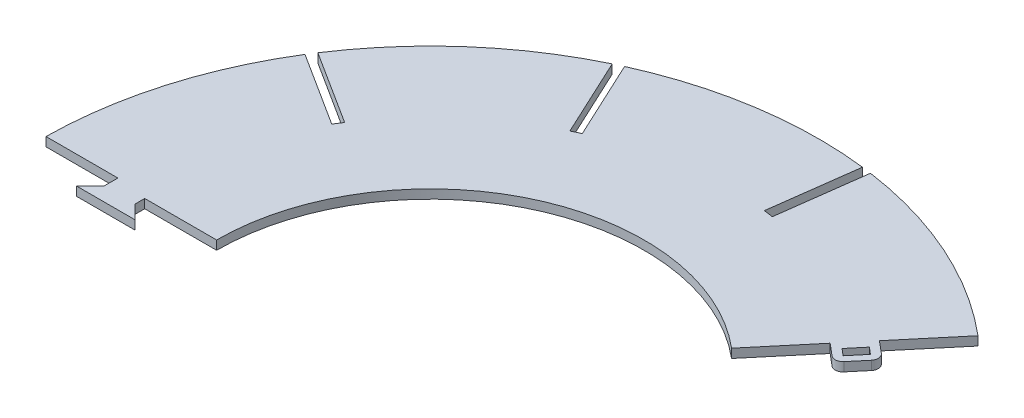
ISO-10303-21;
HEADER;
FILE_DESCRIPTION(('STEP AP214'),'2;1');
FILE_NAME('part.step','',(''),(''),'','','');
FILE_SCHEMA(('AUTOMOTIVE_DESIGN { 1 0 10303 214 1 1 1 1 }'));
ENDSEC;
DATA;
#1=APPLICATION_CONTEXT('core data for automotive mechanical design processes');
#2=APPLICATION_PROTOCOL_DEFINITION('international standard','automotive_design',2000,#1);
#3=PRODUCT_CONTEXT('',#1,'mechanical');
#4=PRODUCT('Part','Part','',(#3));
#5=PRODUCT_RELATED_PRODUCT_CATEGORY('part','',(#4));
#6=PRODUCT_DEFINITION_FORMATION('','',#4);
#7=PRODUCT_DEFINITION_CONTEXT('part definition',#1,'design');
#8=PRODUCT_DEFINITION('design','',#6,#7);
#9=PRODUCT_DEFINITION_SHAPE('','',#8);
#10=(LENGTH_UNIT() NAMED_UNIT(*) SI_UNIT(.MILLI.,.METRE.));
#11=(NAMED_UNIT(*) PLANE_ANGLE_UNIT() SI_UNIT($,.RADIAN.));
#12=(NAMED_UNIT(*) SI_UNIT($,.STERADIAN.) SOLID_ANGLE_UNIT());
#13=UNCERTAINTY_MEASURE_WITH_UNIT(LENGTH_MEASURE(1.E-05),#10,'distance_accuracy_value','');
#14=(GEOMETRIC_REPRESENTATION_CONTEXT(3) GLOBAL_UNCERTAINTY_ASSIGNED_CONTEXT((#13)) GLOBAL_UNIT_ASSIGNED_CONTEXT((#10,
#11,#12)) REPRESENTATION_CONTEXT('',''));
#15=CARTESIAN_POINT('',(0.,0.,0.));
#16=DIRECTION('',(0.,0.,1.));
#17=DIRECTION('',(1.,0.,0.));
#18=AXIS2_PLACEMENT_3D('',#15,#16,#17);
#19=CARTESIAN_POINT('',(263.891483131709,23.,-314.49362307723));
#20=DIRECTION('',(-0.642787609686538,0.,0.766044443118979));
#21=DIRECTION('',(0.766044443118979,0.,0.642787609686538));
#22=AXIS2_PLACEMENT_3D('',#19,#20,#21);
#23=PLANE('',#22);
#24=DIRECTION('',(-0.766044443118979,0.,-0.642787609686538));
#25=VECTOR('',#24,1.);
#26=CARTESIAN_POINT('',(263.891483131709,0.,-314.49362307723));
#27=LINE('',#26,#25);
#28=CARTESIAN_POINT('',(491.131283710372,0.,-123.816790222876));
#29=VERTEX_POINT('',#28);
#30=CARTESIAN_POINT('',(473.512261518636,0.,-138.600905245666));
#31=VERTEX_POINT('',#30);
#32=EDGE_CURVE('E347',#29,#31,#27,.T.);
#33=ORIENTED_EDGE('',*,*,#32,.T.);
#34=DIRECTION('',(0.,-1.,0.));
#35=VECTOR('',#34,1.);
#36=CARTESIAN_POINT('',(473.512261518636,23.,-138.600905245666));
#37=LINE('',#36,#35);
#38=CARTESIAN_POINT('',(473.512261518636,23.,-138.600905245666));
#39=VERTEX_POINT('',#38);
#40=EDGE_CURVE('E11',#39,#31,#37,.T.);
#41=ORIENTED_EDGE('',*,*,#40,.F.);
#42=DIRECTION('',(-0.766044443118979,0.,-0.642787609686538));
#43=VECTOR('',#42,1.);
#44=CARTESIAN_POINT('',(263.891483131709,23.,-314.49362307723));
#45=LINE('',#44,#43);
#46=CARTESIAN_POINT('',(491.131283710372,23.,-123.816790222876));
#47=VERTEX_POINT('',#46);
#48=EDGE_CURVE('E257',#47,#39,#45,.T.);
#49=ORIENTED_EDGE('',*,*,#48,.F.);
#50=DIRECTION('',(0.,-1.,0.));
#51=VECTOR('',#50,1.);
#52=CARTESIAN_POINT('',(491.131283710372,23.,-123.816790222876));
#53=LINE('',#52,#51);
#54=EDGE_CURVE('E53',#47,#29,#53,.T.);
#55=ORIENTED_EDGE('',*,*,#54,.T.);
#56=EDGE_LOOP('',(#33,#41,#49,#55));
#57=FACE_BOUND('',#56,.T.);
#58=ADVANCED_FACE('F34',(#57),#23,.F.);
#59=CARTESIAN_POINT('',(209.620778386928,23.,175.892717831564));
#60=DIRECTION('',(-0.766044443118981,0.,-0.642787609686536));
#61=DIRECTION('',(-0.642787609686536,0.,0.766044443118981));
#62=AXIS2_PLACEMENT_3D('',#59,#60,#61);
#63=PLANE('',#62);
#64=DIRECTION('',(0.642787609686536,0.,-0.766044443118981));
#65=VECTOR('',#64,1.);
#66=CARTESIAN_POINT('',(209.620778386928,0.,175.892717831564));
#67=LINE('',#66,#65);
#68=CARTESIAN_POINT('',(505.651642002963,0.,-176.903127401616));
#69=VERTEX_POINT('',#68);
#70=EDGE_CURVE('E263',#31,#69,#67,.T.);
#71=ORIENTED_EDGE('',*,*,#70,.T.);
#72=DIRECTION('',(0.,-1.,0.));
#73=VECTOR('',#72,1.);
#74=CARTESIAN_POINT('',(505.651642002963,23.,-176.903127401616));
#75=LINE('',#74,#73);
#76=CARTESIAN_POINT('',(505.651642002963,23.,-176.903127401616));
#77=VERTEX_POINT('',#76);
#78=EDGE_CURVE('E44',#77,#69,#75,.T.);
#79=ORIENTED_EDGE('',*,*,#78,.F.);
#80=DIRECTION('',(0.642787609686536,0.,-0.766044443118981));
#81=VECTOR('',#80,1.);
#82=CARTESIAN_POINT('',(209.620778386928,23.,175.892717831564));
#83=LINE('',#82,#81);
#84=EDGE_CURVE('E251',#39,#77,#83,.T.);
#85=ORIENTED_EDGE('',*,*,#84,.F.);
#86=ORIENTED_EDGE('',*,*,#40,.T.);
#87=EDGE_LOOP('',(#71,#79,#85,#86));
#88=FACE_BOUND('',#87,.T.);
#89=ADVANCED_FACE('F262',(#88),#63,.F.);
#90=CARTESIAN_POINT('',(296.030863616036,23.,-352.795845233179));
#91=DIRECTION('',(0.642787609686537,0.,-0.76604444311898));
#92=DIRECTION('',(-0.76604444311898,0.,-0.642787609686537));
#93=AXIS2_PLACEMENT_3D('',#90,#91,#92);
#94=PLANE('',#93);
#95=DIRECTION('',(0.76604444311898,0.,0.642787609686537));
#96=VECTOR('',#95,1.);
#97=CARTESIAN_POINT('',(296.030863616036,0.,-352.795845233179));
#98=LINE('',#97,#96);
#99=CARTESIAN_POINT('',(523.270664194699,0.,-162.119012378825));
#100=VERTEX_POINT('',#99);
#101=EDGE_CURVE('E350',#69,#100,#98,.T.);
#102=ORIENTED_EDGE('',*,*,#101,.T.);
#103=DIRECTION('',(0.,-1.,0.));
#104=VECTOR('',#103,1.);
#105=CARTESIAN_POINT('',(523.270664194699,23.,-162.119012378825));
#106=LINE('',#105,#104);
#107=CARTESIAN_POINT('',(523.270664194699,23.,-162.119012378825));
#108=VERTEX_POINT('',#107);
#109=EDGE_CURVE('E152',#108,#100,#106,.T.);
#110=ORIENTED_EDGE('',*,*,#109,.F.);
#111=DIRECTION('',(0.76604444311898,0.,0.642787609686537));
#112=VECTOR('',#111,1.);
#113=CARTESIAN_POINT('',(296.030863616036,23.,-352.795845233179));
#114=LINE('',#113,#112);
#115=EDGE_CURVE('E256',#77,#108,#114,.T.);
#116=ORIENTED_EDGE('',*,*,#115,.F.);
#117=ORIENTED_EDGE('',*,*,#78,.T.);
#118=EDGE_LOOP('',(#102,#110,#116,#117));
#119=FACE_BOUND('',#118,.T.);
#120=ADVANCED_FACE('F267',(#119),#94,.F.);
#121=CARTESIAN_POINT('',(0.,23.,413.040856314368));
#122=DIRECTION('',(0.,0.,1.));
#123=DIRECTION('',(1.,0.,0.));
#124=AXIS2_PLACEMENT_3D('',#121,#122,#123);
#125=PLANE('',#124);
#126=DIRECTION('',(-1.,0.,0.));
#127=VECTOR('',#126,1.);
#128=CARTESIAN_POINT('',(0.,0.,413.040856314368));
#129=LINE('',#128,#127);
#130=CARTESIAN_POINT('',(-837.750267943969,0.,413.040856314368));
#131=VERTEX_POINT('',#130);
#132=CARTESIAN_POINT('',(-1022.68976611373,0.,413.040856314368));
#133=VERTEX_POINT('',#132);
#134=EDGE_CURVE('E274',#131,#133,#129,.T.);
#135=ORIENTED_EDGE('',*,*,#134,.F.);
#136=DIRECTION('',(0.,-1.,0.));
#137=VECTOR('',#136,1.);
#138=CARTESIAN_POINT('',(-837.750267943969,23.,413.040856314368));
#139=LINE('',#138,#137);
#140=CARTESIAN_POINT('',(-837.750267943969,23.,413.040856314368));
#141=VERTEX_POINT('',#140);
#142=EDGE_CURVE('E38',#141,#131,#139,.T.);
#143=ORIENTED_EDGE('',*,*,#142,.F.);
#144=DIRECTION('',(-1.,0.,0.));
#145=VECTOR('',#144,1.);
#146=CARTESIAN_POINT('',(0.,23.,413.040856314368));
#147=LINE('',#146,#145);
#148=CARTESIAN_POINT('',(-1022.68976611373,23.,413.040856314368));
#149=VERTEX_POINT('',#148);
#150=EDGE_CURVE('E355',#141,#149,#147,.T.);
#151=ORIENTED_EDGE('',*,*,#150,.T.);
#152=DIRECTION('',(0.,-1.,0.));
#153=VECTOR('',#152,1.);
#154=CARTESIAN_POINT('',(-1022.68976611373,23.,413.040856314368));
#155=LINE('',#154,#153);
#156=EDGE_CURVE('E270',#149,#133,#155,.T.);
#157=ORIENTED_EDGE('',*,*,#156,.T.);
#158=EDGE_LOOP('',(#135,#143,#151,#157));
#159=FACE_BOUND('',#158,.T.);
#160=ADVANCED_FACE('F36',(#159),#125,.T.);
#161=CARTESIAN_POINT('',(-837.750267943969,23.,0.));
#162=DIRECTION('',(1.,0.,0.));
#163=DIRECTION('',(0.,0.,-1.));
#164=AXIS2_PLACEMENT_3D('',#161,#162,#163);
#165=PLANE('',#164);
#166=DIRECTION('',(0.,0.,1.));
#167=VECTOR('',#166,1.);
#168=CARTESIAN_POINT('',(-837.750267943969,0.,0.));
#169=LINE('',#168,#167);
#170=CARTESIAN_POINT('',(-837.750267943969,0.,449.040856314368));
#171=VERTEX_POINT('',#170);
#172=EDGE_CURVE('E277',#131,#171,#169,.T.);
#173=ORIENTED_EDGE('',*,*,#172,.T.);
#174=DIRECTION('',(0.,-1.,0.));
#175=VECTOR('',#174,1.);
#176=CARTESIAN_POINT('',(-837.750267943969,23.,449.040856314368));
#177=LINE('',#176,#175);
#178=CARTESIAN_POINT('',(-837.750267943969,23.,449.040856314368));
#179=VERTEX_POINT('',#178);
#180=EDGE_CURVE('E418',#179,#171,#177,.T.);
#181=ORIENTED_EDGE('',*,*,#180,.F.);
#182=DIRECTION('',(0.,0.,1.));
#183=VECTOR('',#182,1.);
#184=CARTESIAN_POINT('',(-837.750267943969,23.,0.));
#185=LINE('',#184,#183);
#186=EDGE_CURVE('E427',#141,#179,#185,.T.);
#187=ORIENTED_EDGE('',*,*,#186,.F.);
#188=ORIENTED_EDGE('',*,*,#142,.T.);
#189=EDGE_LOOP('',(#173,#181,#187,#188));
#190=FACE_BOUND('',#189,.T.);
#191=ADVANCED_FACE('F426',(#190),#165,.F.);
#192=CARTESIAN_POINT('',(-194.354705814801,23.,-194.354705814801));
#193=DIRECTION('',(0.707106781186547,0.,0.707106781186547));
#194=DIRECTION('',(0.707106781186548,0.,-0.707106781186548));
#195=AXIS2_PLACEMENT_3D('',#192,#193,#194);
#196=PLANE('',#195);
#197=DIRECTION('',(-0.707106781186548,0.,0.707106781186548));
#198=VECTOR('',#197,1.);
#199=CARTESIAN_POINT('',(-194.354705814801,0.,-194.354705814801));
#200=LINE('',#199,#198);
#201=CARTESIAN_POINT('',(-872.750267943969,0.,484.040856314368));
#202=VERTEX_POINT('',#201);
#203=EDGE_CURVE('E279',#171,#202,#200,.T.);
#204=ORIENTED_EDGE('',*,*,#203,.T.);
#205=DIRECTION('',(0.,-1.,0.));
#206=VECTOR('',#205,1.);
#207=CARTESIAN_POINT('',(-872.750267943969,23.,484.040856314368));
#208=LINE('',#207,#206);
#209=CARTESIAN_POINT('',(-872.750267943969,23.,484.040856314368));
#210=VERTEX_POINT('',#209);
#211=EDGE_CURVE('E416',#210,#202,#208,.T.);
#212=ORIENTED_EDGE('',*,*,#211,.F.);
#213=DIRECTION('',(-0.707106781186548,0.,0.707106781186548));
#214=VECTOR('',#213,1.);
#215=CARTESIAN_POINT('',(-194.354705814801,23.,-194.354705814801));
#216=LINE('',#215,#214);
#217=EDGE_CURVE('E579',#179,#210,#216,.T.);
#218=ORIENTED_EDGE('',*,*,#217,.F.);
#219=ORIENTED_EDGE('',*,*,#180,.T.);
#220=EDGE_LOOP('',(#204,#212,#218,#219));
#221=FACE_BOUND('',#220,.T.);
#222=ADVANCED_FACE('F578',(#221),#196,.F.);
#223=CARTESIAN_POINT('',(0.,23.,484.040856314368));
#224=DIRECTION('',(0.,0.,-1.));
#225=DIRECTION('',(-1.,0.,0.));
#226=AXIS2_PLACEMENT_3D('',#223,#224,#225);
#227=PLANE('',#226);
#228=DIRECTION('',(1.,0.,0.));
#229=VECTOR('',#228,1.);
#230=CARTESIAN_POINT('',(0.,0.,484.040856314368));
#231=LINE('',#230,#229);
#232=CARTESIAN_POINT('',(-722.750267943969,0.,484.040856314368));
#233=VERTEX_POINT('',#232);
#234=EDGE_CURVE('E281',#202,#233,#231,.T.);
#235=ORIENTED_EDGE('',*,*,#234,.T.);
#236=DIRECTION('',(0.,-1.,0.));
#237=VECTOR('',#236,1.);
#238=CARTESIAN_POINT('',(-722.750267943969,23.,484.040856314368));
#239=LINE('',#238,#237);
#240=CARTESIAN_POINT('',(-722.750267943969,23.,484.040856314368));
#241=VERTEX_POINT('',#240);
#242=EDGE_CURVE('E413',#241,#233,#239,.T.);
#243=ORIENTED_EDGE('',*,*,#242,.F.);
#244=DIRECTION('',(1.,0.,0.));
#245=VECTOR('',#244,1.);
#246=CARTESIAN_POINT('',(0.,23.,484.040856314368));
#247=LINE('',#246,#245);
#248=EDGE_CURVE('E577',#210,#241,#247,.T.);
#249=ORIENTED_EDGE('',*,*,#248,.F.);
#250=ORIENTED_EDGE('',*,*,#211,.T.);
#251=EDGE_LOOP('',(#235,#243,#249,#250));
#252=FACE_BOUND('',#251,.T.);
#253=ADVANCED_FACE('F574',(#252),#227,.F.);
#254=CARTESIAN_POINT('',(-603.395562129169,23.,603.395562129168));
#255=DIRECTION('',(-0.707106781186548,0.,0.707106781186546));
#256=DIRECTION('',(0.707106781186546,0.,0.707106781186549));
#257=AXIS2_PLACEMENT_3D('',#254,#255,#256);
#258=PLANE('',#257);
#259=DIRECTION('',(-0.707106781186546,0.,-0.707106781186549));
#260=VECTOR('',#259,1.);
#261=CARTESIAN_POINT('',(-603.395562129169,0.,603.395562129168));
#262=LINE('',#261,#260);
#263=CARTESIAN_POINT('',(-757.750267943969,0.,449.040856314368));
#264=VERTEX_POINT('',#263);
#265=EDGE_CURVE('E283',#233,#264,#262,.T.);
#266=ORIENTED_EDGE('',*,*,#265,.T.);
#267=DIRECTION('',(0.,-1.,0.));
#268=VECTOR('',#267,1.);
#269=CARTESIAN_POINT('',(-757.750267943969,23.,449.040856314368));
#270=LINE('',#269,#268);
#271=CARTESIAN_POINT('',(-757.750267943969,23.,449.040856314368));
#272=VERTEX_POINT('',#271);
#273=EDGE_CURVE('E410',#272,#264,#270,.T.);
#274=ORIENTED_EDGE('',*,*,#273,.F.);
#275=DIRECTION('',(-0.707106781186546,0.,-0.707106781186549));
#276=VECTOR('',#275,1.);
#277=CARTESIAN_POINT('',(-603.395562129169,23.,603.395562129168));
#278=LINE('',#277,#276);
#279=EDGE_CURVE('E571',#241,#272,#278,.T.);
#280=ORIENTED_EDGE('',*,*,#279,.F.);
#281=ORIENTED_EDGE('',*,*,#242,.T.);
#282=EDGE_LOOP('',(#266,#274,#280,#281));
#283=FACE_BOUND('',#282,.T.);
#284=ADVANCED_FACE('F570',(#283),#258,.F.);
#285=CARTESIAN_POINT('',(-757.750267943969,23.,0.));
#286=DIRECTION('',(-1.,0.,0.));
#287=DIRECTION('',(0.,0.,1.));
#288=AXIS2_PLACEMENT_3D('',#285,#286,#287);
#289=PLANE('',#288);
#290=DIRECTION('',(0.,0.,-1.));
#291=VECTOR('',#290,1.);
#292=CARTESIAN_POINT('',(-757.750267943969,0.,0.));
#293=LINE('',#292,#291);
#294=CARTESIAN_POINT('',(-757.750267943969,0.,424.040856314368));
#295=VERTEX_POINT('',#294);
#296=EDGE_CURVE('E285',#264,#295,#293,.T.);
#297=ORIENTED_EDGE('',*,*,#296,.T.);
#298=DIRECTION('',(0.,-1.,0.));
#299=VECTOR('',#298,1.);
#300=CARTESIAN_POINT('',(-757.750267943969,23.,424.040856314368));
#301=LINE('',#300,#299);
#302=CARTESIAN_POINT('',(-757.750267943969,23.,424.040856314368));
#303=VERTEX_POINT('',#302);
#304=EDGE_CURVE('E408',#303,#295,#301,.T.);
#305=ORIENTED_EDGE('',*,*,#304,.F.);
#306=DIRECTION('',(0.,0.,-1.));
#307=VECTOR('',#306,1.);
#308=CARTESIAN_POINT('',(-757.750267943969,23.,0.));
#309=LINE('',#308,#307);
#310=EDGE_CURVE('E567',#272,#303,#309,.T.);
#311=ORIENTED_EDGE('',*,*,#310,.F.);
#312=ORIENTED_EDGE('',*,*,#273,.T.);
#313=EDGE_LOOP('',(#297,#305,#311,#312));
#314=FACE_BOUND('',#313,.T.);
#315=ADVANCED_FACE('F565',(#314),#289,.F.);
#316=CARTESIAN_POINT('',(0.,23.,424.040856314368));
#317=DIRECTION('',(0.,0.,1.));
#318=DIRECTION('',(1.,0.,0.));
#319=AXIS2_PLACEMENT_3D('',#316,#317,#318);
#320=PLANE('',#319);
#321=DIRECTION('',(-1.,0.,0.));
#322=VECTOR('',#321,1.);
#323=CARTESIAN_POINT('',(0.,0.,424.040856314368));
#324=LINE('',#323,#322);
#325=CARTESIAN_POINT('',(-572.750267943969,0.,424.040856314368));
#326=VERTEX_POINT('',#325);
#327=EDGE_CURVE('E288',#326,#295,#324,.T.);
#328=ORIENTED_EDGE('',*,*,#327,.F.);
#329=DIRECTION('',(0.,-1.,0.));
#330=VECTOR('',#329,1.);
#331=CARTESIAN_POINT('',(-572.750267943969,23.,424.040856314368));
#332=LINE('',#331,#330);
#333=CARTESIAN_POINT('',(-572.750267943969,23.,424.040856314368));
#334=VERTEX_POINT('',#333);
#335=EDGE_CURVE('E406',#334,#326,#332,.T.);
#336=ORIENTED_EDGE('',*,*,#335,.F.);
#337=DIRECTION('',(-1.,0.,0.));
#338=VECTOR('',#337,1.);
#339=CARTESIAN_POINT('',(0.,23.,424.040856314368));
#340=LINE('',#339,#338);
#341=EDGE_CURVE('E562',#334,#303,#340,.T.);
#342=ORIENTED_EDGE('',*,*,#341,.T.);
#343=ORIENTED_EDGE('',*,*,#304,.T.);
#344=EDGE_LOOP('',(#328,#336,#342,#343));
#345=FACE_BOUND('',#344,.T.);
#346=ADVANCED_FACE('F558',(#345),#320,.T.);
#347=CARTESIAN_POINT('',(-22.7502679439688,23.,424.040856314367));
#348=DIRECTION('',(0.,-1.,0.));
#349=DIRECTION('',(0.,0.,-1.));
#350=AXIS2_PLACEMENT_3D('',#347,#348,#349);
#351=CYLINDRICAL_SURFACE('',#350,550.);
#352=CARTESIAN_POINT('',(-22.7502679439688,0.,424.040856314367));
#353=DIRECTION('',(0.,1.,0.));
#354=DIRECTION('',(0.,0.,1.));
#355=AXIS2_PLACEMENT_3D('',#352,#353,#354);
#356=CIRCLE('',#355,550.);
#357=CARTESIAN_POINT('',(330.782917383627,0.,2.71641259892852));
#358=VERTEX_POINT('',#357);
#359=EDGE_CURVE('E291',#358,#326,#356,.T.);
#360=ORIENTED_EDGE('',*,*,#359,.F.);
#361=DIRECTION('',(0.,-1.,0.));
#362=VECTOR('',#361,1.);
#363=CARTESIAN_POINT('',(330.782917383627,23.,2.71641259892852));
#364=LINE('',#363,#362);
#365=CARTESIAN_POINT('',(330.782917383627,23.,2.71641259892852));
#366=VERTEX_POINT('',#365);
#367=EDGE_CURVE('E404',#366,#358,#364,.T.);
#368=ORIENTED_EDGE('',*,*,#367,.F.);
#369=CARTESIAN_POINT('',(-22.7502679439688,23.,424.040856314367));
#370=DIRECTION('',(0.,1.,0.));
#371=DIRECTION('',(0.,0.,1.));
#372=AXIS2_PLACEMENT_3D('',#369,#370,#371);
#373=CIRCLE('',#372,550.);
#374=EDGE_CURVE('E553',#366,#334,#373,.T.);
#375=ORIENTED_EDGE('',*,*,#374,.T.);
#376=ORIENTED_EDGE('',*,*,#335,.T.);
#377=EDGE_LOOP('',(#360,#368,#375,#376));
#378=FACE_BOUND('',#377,.T.);
#379=ADVANCED_FACE('F552',(#378),#351,.F.);
#380=CARTESIAN_POINT('',(195.448956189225,23.,164.001147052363));
#381=DIRECTION('',(-0.766044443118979,0.,-0.642787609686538));
#382=DIRECTION('',(-0.642787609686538,0.,0.766044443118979));
#383=AXIS2_PLACEMENT_3D('',#380,#381,#382);
#384=PLANE('',#383);
#385=DIRECTION('',(0.642787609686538,0.,-0.766044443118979));
#386=VECTOR('',#385,1.);
#387=CARTESIAN_POINT('',(195.448956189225,0.,164.001147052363));
#388=LINE('',#387,#386);
#389=CARTESIAN_POINT('',(446.484687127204,0.,-135.171587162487));
#390=VERTEX_POINT('',#389);
#391=EDGE_CURVE('E294',#358,#390,#388,.T.);
#392=ORIENTED_EDGE('',*,*,#391,.T.);
#393=DIRECTION('',(0.,-1.,0.));
#394=VECTOR('',#393,1.);
#395=CARTESIAN_POINT('',(446.484687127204,23.,-135.171587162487));
#396=LINE('',#395,#394);
#397=CARTESIAN_POINT('',(446.484687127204,23.,-135.171587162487));
#398=VERTEX_POINT('',#397);
#399=EDGE_CURVE('E402',#398,#390,#396,.T.);
#400=ORIENTED_EDGE('',*,*,#399,.F.);
#401=DIRECTION('',(0.642787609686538,0.,-0.766044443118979));
#402=VECTOR('',#401,1.);
#403=CARTESIAN_POINT('',(195.448956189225,23.,164.001147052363));
#404=LINE('',#403,#402);
#405=EDGE_CURVE('E548',#366,#398,#404,.T.);
#406=ORIENTED_EDGE('',*,*,#405,.F.);
#407=ORIENTED_EDGE('',*,*,#367,.T.);
#408=EDGE_LOOP('',(#392,#400,#406,#407));
#409=FACE_BOUND('',#408,.T.);
#410=ADVANCED_FACE('F547',(#409),#384,.F.);
#411=CARTESIAN_POINT('',(251.035730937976,23.,-299.172734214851));
#412=DIRECTION('',(-0.642787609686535,0.,0.766044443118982));
#413=DIRECTION('',(0.766044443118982,0.,0.642787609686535));
#414=AXIS2_PLACEMENT_3D('',#411,#412,#413);
#415=PLANE('',#414);
#416=DIRECTION('',(-0.766044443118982,0.,-0.642787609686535));
#417=VECTOR('',#416,1.);
#418=CARTESIAN_POINT('',(251.035730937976,0.,-299.172734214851));
#419=LINE('',#418,#417);
#420=CARTESIAN_POINT('',(477.126464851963,0.,-109.460082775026));
#421=VERTEX_POINT('',#420);
#422=EDGE_CURVE('E297',#421,#390,#419,.T.);
#423=ORIENTED_EDGE('',*,*,#422,.F.);
#424=DIRECTION('',(0.,-1.,0.));
#425=VECTOR('',#424,1.);
#426=CARTESIAN_POINT('',(477.126464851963,23.,-109.460082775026));
#427=LINE('',#426,#425);
#428=CARTESIAN_POINT('',(477.126464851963,23.,-109.460082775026));
#429=VERTEX_POINT('',#428);
#430=EDGE_CURVE('E400',#429,#421,#427,.T.);
#431=ORIENTED_EDGE('',*,*,#430,.F.);
#432=DIRECTION('',(-0.766044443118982,0.,-0.642787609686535));
#433=VECTOR('',#432,1.);
#434=CARTESIAN_POINT('',(251.035730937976,23.,-299.172734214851));
#435=LINE('',#434,#433);
#436=EDGE_CURVE('E544',#429,#398,#435,.T.);
#437=ORIENTED_EDGE('',*,*,#436,.T.);
#438=ORIENTED_EDGE('',*,*,#399,.T.);
#439=EDGE_LOOP('',(#423,#431,#437,#438));
#440=FACE_BOUND('',#439,.T.);
#441=ADVANCED_FACE('F540',(#440),#415,.T.);
#442=CARTESIAN_POINT('',(489.982217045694,23.,-124.780971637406));
#443=DIRECTION('',(0.,-1.,0.));
#444=DIRECTION('',(0.,0.,-1.));
#445=AXIS2_PLACEMENT_3D('',#442,#443,#444);
#446=CYLINDRICAL_SURFACE('',#445,20.);
#447=CARTESIAN_POINT('',(489.982217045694,0.,-124.780971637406));
#448=DIRECTION('',(0.,1.,0.));
#449=DIRECTION('',(0.,0.,1.));
#450=AXIS2_PLACEMENT_3D('',#447,#448,#449);
#451=CIRCLE('',#450,20.);
#452=CARTESIAN_POINT('',(505.303105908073,0.,-111.925219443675));
#453=VERTEX_POINT('',#452);
#454=EDGE_CURVE('E300',#453,#421,#451,.F.);
#455=ORIENTED_EDGE('',*,*,#454,.F.);
#456=DIRECTION('',(0.,-1.,0.));
#457=VECTOR('',#456,1.);
#458=CARTESIAN_POINT('',(505.303105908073,23.,-111.925219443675));
#459=LINE('',#458,#457);
#460=CARTESIAN_POINT('',(505.303105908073,23.,-111.925219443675));
#461=VERTEX_POINT('',#460);
#462=EDGE_CURVE('E398',#461,#453,#459,.T.);
#463=ORIENTED_EDGE('',*,*,#462,.F.);
#464=CARTESIAN_POINT('',(489.982217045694,23.,-124.780971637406));
#465=DIRECTION('',(0.,1.,0.));
#466=DIRECTION('',(0.,0.,1.));
#467=AXIS2_PLACEMENT_3D('',#464,#465,#466);
#468=CIRCLE('',#467,20.);
#469=EDGE_CURVE('E535',#461,#429,#468,.F.);
#470=ORIENTED_EDGE('',*,*,#469,.T.);
#471=ORIENTED_EDGE('',*,*,#430,.T.);
#472=EDGE_LOOP('',(#455,#463,#470,#471));
#473=FACE_BOUND('',#472,.T.);
#474=ADVANCED_FACE('F534',(#473),#446,.T.);
#475=CARTESIAN_POINT('',(241.411622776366,23.,202.568403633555));
#476=DIRECTION('',(-0.766044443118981,0.,-0.642787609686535));
#477=DIRECTION('',(-0.642787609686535,0.,0.766044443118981));
#478=AXIS2_PLACEMENT_3D('',#475,#476,#477);
#479=PLANE('',#478);
#480=DIRECTION('',(0.642787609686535,0.,-0.766044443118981));
#481=VECTOR('',#480,1.);
#482=CARTESIAN_POINT('',(241.411622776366,0.,202.568403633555));
#483=LINE('',#482,#481);
#484=CARTESIAN_POINT('',(537.4424863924,0.,-150.227441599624));
#485=VERTEX_POINT('',#484);
#486=EDGE_CURVE('E303',#453,#485,#483,.T.);
#487=ORIENTED_EDGE('',*,*,#486,.T.);
#488=DIRECTION('',(0.,-1.,0.));
#489=VECTOR('',#488,1.);
#490=CARTESIAN_POINT('',(537.4424863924,23.,-150.227441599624));
#491=LINE('',#490,#489);
#492=CARTESIAN_POINT('',(537.4424863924,23.,-150.227441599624));
#493=VERTEX_POINT('',#492);
#494=EDGE_CURVE('E395',#493,#485,#491,.T.);
#495=ORIENTED_EDGE('',*,*,#494,.F.);
#496=DIRECTION('',(0.642787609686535,0.,-0.766044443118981));
#497=VECTOR('',#496,1.);
#498=CARTESIAN_POINT('',(241.411622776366,23.,202.568403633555));
#499=LINE('',#498,#497);
#500=EDGE_CURVE('E530',#461,#493,#499,.T.);
#501=ORIENTED_EDGE('',*,*,#500,.F.);
#502=ORIENTED_EDGE('',*,*,#462,.T.);
#503=EDGE_LOOP('',(#487,#495,#501,#502));
#504=FACE_BOUND('',#503,.T.);
#505=ADVANCED_FACE('F529',(#504),#479,.F.);
#506=CARTESIAN_POINT('',(522.121597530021,23.,-163.083193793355));
#507=DIRECTION('',(0.,-1.,0.));
#508=DIRECTION('',(0.,0.,-1.));
#509=AXIS2_PLACEMENT_3D('',#506,#507,#508);
#510=CYLINDRICAL_SURFACE('',#509,19.9999999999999);
#511=CARTESIAN_POINT('',(522.121597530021,0.,-163.083193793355));
#512=DIRECTION('',(0.,1.,0.));
#513=DIRECTION('',(0.,0.,1.));
#514=AXIS2_PLACEMENT_3D('',#511,#512,#513);
#515=CIRCLE('',#514,19.9999999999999);
#516=CARTESIAN_POINT('',(534.977349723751,0.,-178.404082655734));
#517=VERTEX_POINT('',#516);
#518=EDGE_CURVE('E305',#485,#517,#515,.T.);
#519=ORIENTED_EDGE('',*,*,#518,.T.);
#520=DIRECTION('',(0.,-1.,0.));
#521=VECTOR('',#520,1.);
#522=CARTESIAN_POINT('',(534.977349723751,23.,-178.404082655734));
#523=LINE('',#522,#521);
#524=CARTESIAN_POINT('',(534.977349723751,23.,-178.404082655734));
#525=VERTEX_POINT('',#524);
#526=EDGE_CURVE('E393',#525,#517,#523,.T.);
#527=ORIENTED_EDGE('',*,*,#526,.F.);
#528=CARTESIAN_POINT('',(522.121597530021,23.,-163.083193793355));
#529=DIRECTION('',(0.,1.,0.));
#530=DIRECTION('',(0.,0.,1.));
#531=AXIS2_PLACEMENT_3D('',#528,#529,#530);
#532=CIRCLE('',#531,19.9999999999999);
#533=EDGE_CURVE('E526',#493,#525,#532,.T.);
#534=ORIENTED_EDGE('',*,*,#533,.F.);
#535=ORIENTED_EDGE('',*,*,#494,.T.);
#536=EDGE_LOOP('',(#519,#527,#534,#535));
#537=FACE_BOUND('',#536,.T.);
#538=ADVANCED_FACE('F523',(#537),#510,.T.);
#539=CARTESIAN_POINT('',(308.88661580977,23.,-368.116734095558));
#540=DIRECTION('',(0.642787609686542,0.,-0.766044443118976));
#541=DIRECTION('',(-0.766044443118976,0.,-0.642787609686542));
#542=AXIS2_PLACEMENT_3D('',#539,#540,#541);
#543=PLANE('',#542);
#544=DIRECTION('',(0.766044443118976,0.,0.642787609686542));
#545=VECTOR('',#544,1.);
#546=CARTESIAN_POINT('',(308.88661580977,0.,-368.116734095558));
#547=LINE('',#546,#545);
#548=CARTESIAN_POINT('',(504.335571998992,0.,-204.115587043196));
#549=VERTEX_POINT('',#548);
#550=EDGE_CURVE('E308',#549,#517,#547,.T.);
#551=ORIENTED_EDGE('',*,*,#550,.F.);
#552=DIRECTION('',(0.,-1.,0.));
#553=VECTOR('',#552,1.);
#554=CARTESIAN_POINT('',(504.335571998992,23.,-204.115587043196));
#555=LINE('',#554,#553);
#556=CARTESIAN_POINT('',(504.335571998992,23.,-204.115587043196));
#557=VERTEX_POINT('',#556);
#558=EDGE_CURVE('E391',#557,#549,#555,.T.);
#559=ORIENTED_EDGE('',*,*,#558,.F.);
#560=DIRECTION('',(0.766044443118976,0.,0.642787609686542));
#561=VECTOR('',#560,1.);
#562=CARTESIAN_POINT('',(308.88661580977,23.,-368.116734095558));
#563=LINE('',#562,#561);
#564=EDGE_CURVE('E517',#557,#525,#563,.T.);
#565=ORIENTED_EDGE('',*,*,#564,.T.);
#566=ORIENTED_EDGE('',*,*,#526,.T.);
#567=EDGE_LOOP('',(#551,#559,#565,#566));
#568=FACE_BOUND('',#567,.T.);
#569=ADVANCED_FACE('F516',(#568),#543,.T.);
#570=CARTESIAN_POINT('',(195.448956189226,23.,164.001147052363));
#571=DIRECTION('',(-0.76604444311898,0.,-0.642787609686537));
#572=DIRECTION('',(-0.642787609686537,0.,0.76604444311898));
#573=AXIS2_PLACEMENT_3D('',#570,#571,#572);
#574=PLANE('',#573);
#575=DIRECTION('',(0.642787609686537,0.,-0.76604444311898));
#576=VECTOR('',#575,1.);
#577=CARTESIAN_POINT('',(195.448956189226,0.,164.001147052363));
#578=LINE('',#577,#576);
#579=CARTESIAN_POINT('',(620.037341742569,0.,-342.003586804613));
#580=VERTEX_POINT('',#579);
#581=EDGE_CURVE('E311',#549,#580,#578,.T.);
#582=ORIENTED_EDGE('',*,*,#581,.T.);
#583=DIRECTION('',(0.,-1.,0.));
#584=VECTOR('',#583,1.);
#585=CARTESIAN_POINT('',(620.037341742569,23.,-342.003586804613));
#586=LINE('',#585,#584);
#587=CARTESIAN_POINT('',(620.037341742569,23.,-342.003586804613));
#588=VERTEX_POINT('',#587);
#589=EDGE_CURVE('E388',#588,#580,#586,.T.);
#590=ORIENTED_EDGE('',*,*,#589,.F.);
#591=DIRECTION('',(0.642787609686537,0.,-0.76604444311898));
#592=VECTOR('',#591,1.);
#593=CARTESIAN_POINT('',(195.448956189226,23.,164.001147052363));
#594=LINE('',#593,#592);
#595=EDGE_CURVE('E512',#557,#588,#594,.T.);
#596=ORIENTED_EDGE('',*,*,#595,.F.);
#597=ORIENTED_EDGE('',*,*,#558,.T.);
#598=EDGE_LOOP('',(#582,#590,#596,#597));
#599=FACE_BOUND('',#598,.T.);
#600=ADVANCED_FACE('F511',(#599),#574,.F.);
#601=CARTESIAN_POINT('',(-22.7502679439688,23.,424.040856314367));
#602=DIRECTION('',(0.,-1.,0.));
#603=DIRECTION('',(0.,0.,-1.));
#604=AXIS2_PLACEMENT_3D('',#601,#602,#603);
#605=CYLINDRICAL_SURFACE('',#604,1000.);
#606=CARTESIAN_POINT('',(-22.7502679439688,0.,424.040856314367));
#607=DIRECTION('',(0.,1.,0.));
#608=DIRECTION('',(0.,0.,1.));
#609=AXIS2_PLACEMENT_3D('',#606,#607,#608);
#610=CIRCLE('',#609,1000.);
#611=CARTESIAN_POINT('',(119.663864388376,0.,-565.766304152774));
#612=VERTEX_POINT('',#611);
#613=EDGE_CURVE('E313',#580,#612,#610,.T.);
#614=ORIENTED_EDGE('',*,*,#613,.T.);
#615=DIRECTION('',(0.,-1.,0.));
#616=VECTOR('',#615,1.);
#617=CARTESIAN_POINT('',(119.663864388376,23.,-565.766304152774));
#618=LINE('',#617,#616);
#619=CARTESIAN_POINT('',(119.663864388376,23.,-565.766304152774));
#620=VERTEX_POINT('',#619);
#621=EDGE_CURVE('E386',#620,#612,#618,.T.);
#622=ORIENTED_EDGE('',*,*,#621,.F.);
#623=CARTESIAN_POINT('',(-22.7502679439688,23.,424.040856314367));
#624=DIRECTION('',(0.,1.,0.));
#625=DIRECTION('',(0.,0.,1.));
#626=AXIS2_PLACEMENT_3D('',#623,#624,#625);
#627=CIRCLE('',#626,1000.);
#628=EDGE_CURVE('E508',#588,#620,#627,.T.);
#629=ORIENTED_EDGE('',*,*,#628,.F.);
#630=ORIENTED_EDGE('',*,*,#589,.T.);
#631=EDGE_LOOP('',(#614,#622,#629,#630));
#632=FACE_BOUND('',#631,.T.);
#633=ADVANCED_FACE('F505',(#632),#605,.T.);
#634=CARTESIAN_POINT('',(44.4095934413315,23.,5.84663389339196));
#635=DIRECTION('',(-0.991444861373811,0.,-0.130526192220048));
#636=DIRECTION('',(-0.130526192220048,0.,0.991444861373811));
#637=AXIS2_PLACEMENT_3D('',#634,#635,#636);
#638=PLANE('',#637);
#639=DIRECTION('',(0.130526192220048,0.,-0.991444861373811));
#640=VECTOR('',#639,1.);
#641=CARTESIAN_POINT('',(44.4095934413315,0.,5.84663389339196));
#642=LINE('',#641,#640);
#643=CARTESIAN_POINT('',(90.2917106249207,0.,-342.662646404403));
#644=VERTEX_POINT('',#643);
#645=EDGE_CURVE('E316',#644,#612,#642,.T.);
#646=ORIENTED_EDGE('',*,*,#645,.F.);
#647=DIRECTION('',(0.,-1.,0.));
#648=VECTOR('',#647,1.);
#649=CARTESIAN_POINT('',(90.2917106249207,23.,-342.662646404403));
#650=LINE('',#649,#648);
#651=CARTESIAN_POINT('',(90.2917106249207,23.,-342.662646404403));
#652=VERTEX_POINT('',#651);
#653=EDGE_CURVE('E384',#652,#644,#650,.T.);
#654=ORIENTED_EDGE('',*,*,#653,.F.);
#655=DIRECTION('',(0.130526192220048,0.,-0.991444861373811));
#656=VECTOR('',#655,1.);
#657=CARTESIAN_POINT('',(44.4095934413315,23.,5.84663389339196));
#658=LINE('',#657,#656);
#659=EDGE_CURVE('E598',#652,#620,#658,.T.);
#660=ORIENTED_EDGE('',*,*,#659,.T.);
#661=ORIENTED_EDGE('',*,*,#621,.T.);
#662=EDGE_LOOP('',(#646,#654,#660,#661));
#663=FACE_BOUND('',#662,.T.);
#664=ADVANCED_FACE('F499',(#663),#638,.T.);
#665=CARTESIAN_POINT('',(45.8821171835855,23.,-348.509280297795));
#666=DIRECTION('',(0.130526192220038,0.,-0.991444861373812));
#667=DIRECTION('',(-0.991444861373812,0.,-0.130526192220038));
#668=AXIS2_PLACEMENT_3D('',#665,#666,#667);
#669=PLANE('',#668);
#670=DIRECTION('',(0.991444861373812,0.,0.130526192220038));
#671=VECTOR('',#670,1.);
#672=CARTESIAN_POINT('',(45.8821171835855,0.,-348.509280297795));
#673=LINE('',#672,#671);
#674=CARTESIAN_POINT('',(66.4970339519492,0.,-345.795275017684));
#675=VERTEX_POINT('',#674);
#676=EDGE_CURVE('E319',#675,#644,#673,.T.);
#677=ORIENTED_EDGE('',*,*,#676,.F.);
#678=DIRECTION('',(0.,-1.,0.));
#679=VECTOR('',#678,1.);
#680=CARTESIAN_POINT('',(66.4970339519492,23.,-345.795275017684));
#681=LINE('',#680,#679);
#682=CARTESIAN_POINT('',(66.4970339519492,23.,-345.795275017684));
#683=VERTEX_POINT('',#682);
#684=EDGE_CURVE('E382',#683,#675,#681,.T.);
#685=ORIENTED_EDGE('',*,*,#684,.F.);
#686=DIRECTION('',(0.991444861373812,0.,0.130526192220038));
#687=VECTOR('',#686,1.);
#688=CARTESIAN_POINT('',(45.8821171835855,23.,-348.509280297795));
#689=LINE('',#688,#687);
#690=EDGE_CURVE('E495',#683,#652,#689,.T.);
#691=ORIENTED_EDGE('',*,*,#690,.T.);
#692=ORIENTED_EDGE('',*,*,#653,.T.);
#693=EDGE_LOOP('',(#677,#685,#691,#692));
#694=FACE_BOUND('',#693,.T.);
#695=ADVANCED_FACE('F490',(#694),#669,.T.);
#696=CARTESIAN_POINT('',(20.6149167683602,23.,2.71400528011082));
#697=DIRECTION('',(-0.991444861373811,0.,-0.130526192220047));
#698=DIRECTION('',(-0.130526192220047,0.,0.991444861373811));
#699=AXIS2_PLACEMENT_3D('',#696,#697,#698);
#700=PLANE('',#699);
#701=DIRECTION('',(0.130526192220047,0.,-0.991444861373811));
#702=VECTOR('',#701,1.);
#703=CARTESIAN_POINT('',(20.6149167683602,0.,2.71400528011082));
#704=LINE('',#703,#702);
#705=CARTESIAN_POINT('',(95.8691877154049,0.,-568.898932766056));
#706=VERTEX_POINT('',#705);
#707=EDGE_CURVE('E322',#675,#706,#704,.T.);
#708=ORIENTED_EDGE('',*,*,#707,.T.);
#709=DIRECTION('',(0.,-1.,0.));
#710=VECTOR('',#709,1.);
#711=CARTESIAN_POINT('',(95.8691877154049,23.,-568.898932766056));
#712=LINE('',#711,#710);
#713=CARTESIAN_POINT('',(95.8691877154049,23.,-568.898932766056));
#714=VERTEX_POINT('',#713);
#715=EDGE_CURVE('E379',#714,#706,#712,.T.);
#716=ORIENTED_EDGE('',*,*,#715,.F.);
#717=DIRECTION('',(0.130526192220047,0.,-0.991444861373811));
#718=VECTOR('',#717,1.);
#719=CARTESIAN_POINT('',(20.6149167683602,23.,2.71400528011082));
#720=LINE('',#719,#718);
#721=EDGE_CURVE('E601',#683,#714,#720,.T.);
#722=ORIENTED_EDGE('',*,*,#721,.F.);
#723=ORIENTED_EDGE('',*,*,#684,.T.);
#724=EDGE_LOOP('',(#708,#716,#722,#723));
#725=FACE_BOUND('',#724,.T.);
#726=ADVANCED_FACE('F613',(#725),#700,.F.);
#727=CARTESIAN_POINT('',(-22.7502679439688,23.,424.040856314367));
#728=DIRECTION('',(0.,-1.,0.));
#729=DIRECTION('',(0.,0.,-1.));
#730=AXIS2_PLACEMENT_3D('',#727,#728,#729);
#731=CYLINDRICAL_SURFACE('',#730,1000.);
#732=CARTESIAN_POINT('',(-22.7502679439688,0.,424.040856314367));
#733=DIRECTION('',(0.,1.,0.));
#734=DIRECTION('',(0.,0.,1.));
#735=AXIS2_PLACEMENT_3D('',#732,#733,#734);
#736=CIRCLE('',#735,1000.);
#737=CARTESIAN_POINT('',(-434.462406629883,0.,-487.273093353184));
#738=VERTEX_POINT('',#737);
#739=EDGE_CURVE('E324',#706,#738,#736,.T.);
#740=ORIENTED_EDGE('',*,*,#739,.T.);
#741=DIRECTION('',(0.,-1.,0.));
#742=VECTOR('',#741,1.);
#743=CARTESIAN_POINT('',(-434.462406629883,23.,-487.273093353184));
#744=LINE('',#743,#742);
#745=CARTESIAN_POINT('',(-434.462406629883,23.,-487.273093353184));
#746=VERTEX_POINT('',#745);
#747=EDGE_CURVE('E377',#746,#738,#744,.T.);
#748=ORIENTED_EDGE('',*,*,#747,.F.);
#749=CARTESIAN_POINT('',(-22.7502679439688,23.,424.040856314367));
#750=DIRECTION('',(0.,1.,0.));
#751=DIRECTION('',(0.,0.,1.));
#752=AXIS2_PLACEMENT_3D('',#749,#750,#751);
#753=CIRCLE('',#752,1000.);
#754=EDGE_CURVE('E603',#714,#746,#753,.T.);
#755=ORIENTED_EDGE('',*,*,#754,.F.);
#756=ORIENTED_EDGE('',*,*,#715,.T.);
#757=EDGE_LOOP('',(#740,#748,#755,#756));
#758=FACE_BOUND('',#757,.T.);
#759=ADVANCED_FACE('F484',(#758),#731,.T.);
#760=CARTESIAN_POINT('',(-170.228306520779,23.,79.3787629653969));
#761=DIRECTION('',(-0.906307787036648,0.,0.422618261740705));
#762=DIRECTION('',(0.422618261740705,0.,0.906307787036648));
#763=AXIS2_PLACEMENT_3D('',#760,#761,#762);
#764=PLANE('',#763);
#765=DIRECTION('',(-0.422618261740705,0.,-0.906307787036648));
#766=VECTOR('',#765,1.);
#767=CARTESIAN_POINT('',(-170.228306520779,0.,79.3787629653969));
#768=LINE('',#767,#766);
#769=CARTESIAN_POINT('',(-339.361121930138,0.,-283.327730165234));
#770=VERTEX_POINT('',#769);
#771=EDGE_CURVE('E327',#770,#738,#768,.T.);
#772=ORIENTED_EDGE('',*,*,#771,.F.);
#773=DIRECTION('',(0.,-1.,0.));
#774=VECTOR('',#773,1.);
#775=CARTESIAN_POINT('',(-339.361121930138,23.,-283.327730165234));
#776=LINE('',#775,#774);
#777=CARTESIAN_POINT('',(-339.361121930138,23.,-283.327730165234));
#778=VERTEX_POINT('',#777);
#779=EDGE_CURVE('E375',#778,#770,#776,.T.);
#780=ORIENTED_EDGE('',*,*,#779,.F.);
#781=DIRECTION('',(-0.422618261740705,0.,-0.906307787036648));
#782=VECTOR('',#781,1.);
#783=CARTESIAN_POINT('',(-170.228306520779,23.,79.3787629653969));
#784=LINE('',#783,#782);
#785=EDGE_CURVE('E481',#778,#746,#784,.T.);
#786=ORIENTED_EDGE('',*,*,#785,.T.);
#787=ORIENTED_EDGE('',*,*,#747,.T.);
#788=EDGE_LOOP('',(#772,#780,#786,#787));
#789=FACE_BOUND('',#788,.T.);
#790=ADVANCED_FACE('F478',(#789),#764,.T.);
#791=CARTESIAN_POINT('',(-169.132815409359,23.,-362.706493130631));
#792=DIRECTION('',(0.422618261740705,0.,0.906307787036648));
#793=DIRECTION('',(0.906307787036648,0.,-0.422618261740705));
#794=AXIS2_PLACEMENT_3D('',#791,#792,#793);
#795=PLANE('',#794);
#796=DIRECTION('',(-0.906307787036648,0.,0.422618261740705));
#797=VECTOR('',#796,1.);
#798=CARTESIAN_POINT('',(-169.132815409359,0.,-362.706493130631));
#799=LINE('',#798,#797);
#800=CARTESIAN_POINT('',(-361.112508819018,0.,-273.184891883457));
#801=VERTEX_POINT('',#800);
#802=EDGE_CURVE('E330',#770,#801,#799,.T.);
#803=ORIENTED_EDGE('',*,*,#802,.T.);
#804=DIRECTION('',(0.,-1.,0.));
#805=VECTOR('',#804,1.);
#806=CARTESIAN_POINT('',(-361.112508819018,23.,-273.184891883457));
#807=LINE('',#806,#805);
#808=CARTESIAN_POINT('',(-361.112508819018,23.,-273.184891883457));
#809=VERTEX_POINT('',#808);
#810=EDGE_CURVE('E372',#809,#801,#807,.T.);
#811=ORIENTED_EDGE('',*,*,#810,.F.);
#812=DIRECTION('',(-0.906307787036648,0.,0.422618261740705));
#813=VECTOR('',#812,1.);
#814=CARTESIAN_POINT('',(-169.132815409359,23.,-362.706493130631));
#815=LINE('',#814,#813);
#816=EDGE_CURVE('E473',#778,#809,#815,.T.);
#817=ORIENTED_EDGE('',*,*,#816,.F.);
#818=ORIENTED_EDGE('',*,*,#779,.T.);
#819=EDGE_LOOP('',(#803,#811,#817,#818));
#820=FACE_BOUND('',#819,.T.);
#821=ADVANCED_FACE('F472',(#820),#795,.F.);
#822=CARTESIAN_POINT('',(-191.979693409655,23.,89.521601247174));
#823=DIRECTION('',(-0.906307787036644,0.,0.422618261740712));
#824=DIRECTION('',(0.422618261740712,0.,0.906307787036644));
#825=AXIS2_PLACEMENT_3D('',#822,#823,#824);
#826=PLANE('',#825);
#827=DIRECTION('',(-0.422618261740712,0.,-0.906307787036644));
#828=VECTOR('',#827,1.);
#829=CARTESIAN_POINT('',(-191.979693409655,0.,89.521601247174));
#830=LINE('',#829,#828);
#831=CARTESIAN_POINT('',(-456.213793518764,0.,-477.130255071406));
#832=VERTEX_POINT('',#831);
#833=EDGE_CURVE('E332',#801,#832,#830,.T.);
#834=ORIENTED_EDGE('',*,*,#833,.T.);
#835=DIRECTION('',(0.,-1.,0.));
#836=VECTOR('',#835,1.);
#837=CARTESIAN_POINT('',(-456.213793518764,23.,-477.130255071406));
#838=LINE('',#837,#836);
#839=CARTESIAN_POINT('',(-456.213793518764,23.,-477.130255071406));
#840=VERTEX_POINT('',#839);
#841=EDGE_CURVE('E369',#840,#832,#838,.T.);
#842=ORIENTED_EDGE('',*,*,#841,.F.);
#843=DIRECTION('',(-0.422618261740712,0.,-0.906307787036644));
#844=VECTOR('',#843,1.);
#845=CARTESIAN_POINT('',(-191.979693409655,23.,89.521601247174));
#846=LINE('',#845,#844);
#847=EDGE_CURVE('E468',#809,#840,#846,.T.);
#848=ORIENTED_EDGE('',*,*,#847,.F.);
#849=ORIENTED_EDGE('',*,*,#810,.T.);
#850=EDGE_LOOP('',(#834,#842,#848,#849));
#851=FACE_BOUND('',#850,.T.);
#852=ADVANCED_FACE('F467',(#851),#826,.F.);
#853=CARTESIAN_POINT('',(-22.7502679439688,23.,424.040856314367));
#854=DIRECTION('',(0.,-1.,0.));
#855=DIRECTION('',(0.,0.,-1.));
#856=AXIS2_PLACEMENT_3D('',#853,#854,#855);
#857=CYLINDRICAL_SURFACE('',#856,1000.);
#858=CARTESIAN_POINT('',(-22.7502679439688,0.,424.040856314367));
#859=DIRECTION('',(0.,1.,0.));
#860=DIRECTION('',(0.,0.,1.));
#861=AXIS2_PLACEMENT_3D('',#858,#859,#860);
#862=CIRCLE('',#861,1000.);
#863=CARTESIAN_POINT('',(-859.63339208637,0.,-123.340762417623));
#864=VERTEX_POINT('',#863);
#865=EDGE_CURVE('E334',#832,#864,#862,.T.);
#866=ORIENTED_EDGE('',*,*,#865,.T.);
#867=DIRECTION('',(0.,-1.,0.));
#868=VECTOR('',#867,1.);
#869=CARTESIAN_POINT('',(-859.63339208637,23.,-123.340762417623));
#870=LINE('',#869,#868);
#871=CARTESIAN_POINT('',(-859.63339208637,23.,-123.340762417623));
#872=VERTEX_POINT('',#871);
#873=EDGE_CURVE('E367',#872,#864,#870,.T.);
#874=ORIENTED_EDGE('',*,*,#873,.F.);
#875=CARTESIAN_POINT('',(-22.7502679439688,23.,424.040856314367));
#876=DIRECTION('',(0.,1.,0.));
#877=DIRECTION('',(0.,0.,1.));
#878=AXIS2_PLACEMENT_3D('',#875,#876,#877);
#879=CIRCLE('',#878,1000.);
#880=EDGE_CURVE('E464',#840,#872,#879,.T.);
#881=ORIENTED_EDGE('',*,*,#880,.F.);
#882=ORIENTED_EDGE('',*,*,#841,.T.);
#883=EDGE_LOOP('',(#866,#874,#881,#882));
#884=FACE_BOUND('',#883,.T.);
#885=ADVANCED_FACE('F461',(#884),#857,.T.);
#886=CARTESIAN_POINT('',(-192.275964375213,23.,301.812808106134));
#887=DIRECTION('',(-0.537299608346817,0.,0.84339144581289));
#888=DIRECTION('',(0.84339144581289,0.,0.537299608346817));
#889=AXIS2_PLACEMENT_3D('',#886,#887,#888);
#890=PLANE('',#889);
#891=DIRECTION('',(-0.84339144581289,0.,-0.537299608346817));
#892=VECTOR('',#891,1.);
#893=CARTESIAN_POINT('',(-192.275964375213,0.,301.812808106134));
#894=LINE('',#893,#892);
#895=CARTESIAN_POINT('',(-669.852684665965,0.,-2.4371176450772));
#896=VERTEX_POINT('',#895);
#897=EDGE_CURVE('E337',#896,#864,#894,.T.);
#898=ORIENTED_EDGE('',*,*,#897,.F.);
#899=DIRECTION('',(0.,-1.,0.));
#900=VECTOR('',#899,1.);
#901=CARTESIAN_POINT('',(-669.852684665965,23.,-2.4371176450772));
#902=LINE('',#901,#900);
#903=CARTESIAN_POINT('',(-669.852684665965,23.,-2.4371176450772));
#904=VERTEX_POINT('',#903);
#905=EDGE_CURVE('E365',#904,#896,#902,.T.);
#906=ORIENTED_EDGE('',*,*,#905,.F.);
#907=DIRECTION('',(-0.84339144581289,0.,-0.537299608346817));
#908=VECTOR('',#907,1.);
#909=CARTESIAN_POINT('',(-192.275964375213,23.,301.812808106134));
#910=LINE('',#909,#908);
#911=EDGE_CURVE('E455',#904,#872,#910,.T.);
#912=ORIENTED_EDGE('',*,*,#911,.T.);
#913=ORIENTED_EDGE('',*,*,#873,.T.);
#914=EDGE_LOOP('',(#898,#906,#912,#913));
#915=FACE_BOUND('',#914,.T.);
#916=ADVANCED_FACE('F454',(#915),#890,.T.);
#917=CARTESIAN_POINT('',(-477.77629138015,23.,-304.155898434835));
#918=DIRECTION('',(0.8435683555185,0.,0.537021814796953));
#919=DIRECTION('',(0.537021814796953,0.,-0.843568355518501));
#920=AXIS2_PLACEMENT_3D('',#917,#918,#919);
#921=PLANE('',#920);
#922=DIRECTION('',(-0.537021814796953,0.,0.843568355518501));
#923=VECTOR('',#922,1.);
#924=CARTESIAN_POINT('',(-477.77629138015,0.,-304.155898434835));
#925=LINE('',#924,#923);
#926=CARTESIAN_POINT('',(-682.741208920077,0.,17.8085239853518));
#927=VERTEX_POINT('',#926);
#928=EDGE_CURVE('E340',#896,#927,#925,.T.);
#929=ORIENTED_EDGE('',*,*,#928,.T.);
#930=DIRECTION('',(0.,-1.,0.));
#931=VECTOR('',#930,1.);
#932=CARTESIAN_POINT('',(-682.741208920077,23.,17.8085239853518));
#933=LINE('',#932,#931);
#934=CARTESIAN_POINT('',(-682.741208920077,23.,17.8085239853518));
#935=VERTEX_POINT('',#934);
#936=EDGE_CURVE('E362',#935,#927,#933,.T.);
#937=ORIENTED_EDGE('',*,*,#936,.F.);
#938=DIRECTION('',(-0.537021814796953,0.,0.843568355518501));
#939=VECTOR('',#938,1.);
#940=CARTESIAN_POINT('',(-477.77629138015,23.,-304.155898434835));
#941=LINE('',#940,#939);
#942=EDGE_CURVE('E450',#904,#935,#941,.T.);
#943=ORIENTED_EDGE('',*,*,#942,.F.);
#944=ORIENTED_EDGE('',*,*,#905,.T.);
#945=EDGE_LOOP('',(#929,#937,#943,#944));
#946=FACE_BOUND('',#945,.T.);
#947=ADVANCED_FACE('F449',(#946),#921,.F.);
#948=CARTESIAN_POINT('',(-205.171154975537,23.,322.054202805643));
#949=DIRECTION('',(-0.537299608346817,0.,0.84339144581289));
#950=DIRECTION('',(0.84339144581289,0.,0.537299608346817));
#951=AXIS2_PLACEMENT_3D('',#948,#949,#950);
#952=PLANE('',#951);
#953=DIRECTION('',(-0.84339144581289,0.,-0.537299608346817));
#954=VECTOR('',#953,1.);
#955=CARTESIAN_POINT('',(-205.171154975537,0.,322.054202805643));
#956=LINE('',#955,#954);
#957=CARTESIAN_POINT('',(-872.528582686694,0.,-103.099367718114));
#958=VERTEX_POINT('',#957);
#959=EDGE_CURVE('E342',#927,#958,#956,.T.);
#960=ORIENTED_EDGE('',*,*,#959,.T.);
#961=DIRECTION('',(0.,-1.,0.));
#962=VECTOR('',#961,1.);
#963=CARTESIAN_POINT('',(-872.528582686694,23.,-103.099367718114));
#964=LINE('',#963,#962);
#965=CARTESIAN_POINT('',(-872.528582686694,23.,-103.099367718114));
#966=VERTEX_POINT('',#965);
#967=EDGE_CURVE('E359',#966,#958,#964,.T.);
#968=ORIENTED_EDGE('',*,*,#967,.F.);
#969=DIRECTION('',(-0.84339144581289,0.,-0.537299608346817));
#970=VECTOR('',#969,1.);
#971=CARTESIAN_POINT('',(-205.171154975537,23.,322.054202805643));
#972=LINE('',#971,#970);
#973=EDGE_CURVE('E446',#935,#966,#972,.T.);
#974=ORIENTED_EDGE('',*,*,#973,.F.);
#975=ORIENTED_EDGE('',*,*,#936,.T.);
#976=EDGE_LOOP('',(#960,#968,#974,#975));
#977=FACE_BOUND('',#976,.T.);
#978=ADVANCED_FACE('F443',(#977),#952,.F.);
#979=CARTESIAN_POINT('',(-22.7502679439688,23.,424.040856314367));
#980=DIRECTION('',(0.,-1.,0.));
#981=DIRECTION('',(0.,0.,-1.));
#982=AXIS2_PLACEMENT_3D('',#979,#980,#981);
#983=CYLINDRICAL_SURFACE('',#982,1000.);
#984=CARTESIAN_POINT('',(-22.7502679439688,0.,424.040856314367));
#985=DIRECTION('',(0.,1.,0.));
#986=DIRECTION('',(0.,0.,1.));
#987=AXIS2_PLACEMENT_3D('',#984,#985,#986);
#988=CIRCLE('',#987,1000.);
#989=EDGE_CURVE('E344',#958,#133,#988,.T.);
#990=ORIENTED_EDGE('',*,*,#989,.T.);
#991=ORIENTED_EDGE('',*,*,#156,.F.);
#992=CARTESIAN_POINT('',(-22.7502679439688,23.,424.040856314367));
#993=DIRECTION('',(0.,1.,0.));
#994=DIRECTION('',(0.,0.,1.));
#995=AXIS2_PLACEMENT_3D('',#992,#993,#994);
#996=CIRCLE('',#995,1000.);
#997=EDGE_CURVE('E612',#966,#149,#996,.T.);
#998=ORIENTED_EDGE('',*,*,#997,.F.);
#999=ORIENTED_EDGE('',*,*,#967,.T.);
#1000=EDGE_LOOP('',(#990,#991,#998,#999));
#1001=FACE_BOUND('',#1000,.T.);
#1002=ADVANCED_FACE('F437',(#1001),#983,.T.);
#1003=CARTESIAN_POINT('',(227.239800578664,23.,190.676832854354));
#1004=DIRECTION('',(-0.76604444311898,0.,-0.642787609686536));
#1005=DIRECTION('',(-0.642787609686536,0.,0.76604444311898));
#1006=AXIS2_PLACEMENT_3D('',#1003,#1004,#1005);
#1007=PLANE('',#1006);
#1008=DIRECTION('',(0.642787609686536,0.,-0.76604444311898));
#1009=VECTOR('',#1008,1.);
#1010=CARTESIAN_POINT('',(227.239800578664,0.,190.676832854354));
#1011=LINE('',#1010,#1009);
#1012=EDGE_CURVE('E352',#29,#100,#1011,.T.);
#1013=ORIENTED_EDGE('',*,*,#1012,.F.);
#1014=ORIENTED_EDGE('',*,*,#54,.F.);
#1015=DIRECTION('',(0.642787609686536,0.,-0.76604444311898));
#1016=VECTOR('',#1015,1.);
#1017=CARTESIAN_POINT('',(227.239800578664,23.,190.676832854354));
#1018=LINE('',#1017,#1016);
#1019=EDGE_CURVE('E268',#47,#108,#1018,.T.);
#1020=ORIENTED_EDGE('',*,*,#1019,.T.);
#1021=ORIENTED_EDGE('',*,*,#109,.T.);
#1022=EDGE_LOOP('',(#1013,#1014,#1020,#1021));
#1023=FACE_BOUND('',#1022,.T.);
#1024=ADVANCED_FACE('F632',(#1023),#1007,.T.);
#1025=CARTESIAN_POINT('',(0.,23.,0.));
#1026=DIRECTION('',(0.,1.,0.));
#1027=DIRECTION('',(0.,0.,1.));
#1028=AXIS2_PLACEMENT_3D('',#1025,#1026,#1027);
#1029=PLANE('',#1028);
#1030=ORIENTED_EDGE('',*,*,#150,.F.);
#1031=ORIENTED_EDGE('',*,*,#186,.T.);
#1032=ORIENTED_EDGE('',*,*,#217,.T.);
#1033=ORIENTED_EDGE('',*,*,#248,.T.);
#1034=ORIENTED_EDGE('',*,*,#279,.T.);
#1035=ORIENTED_EDGE('',*,*,#310,.T.);
#1036=ORIENTED_EDGE('',*,*,#341,.F.);
#1037=ORIENTED_EDGE('',*,*,#374,.F.);
#1038=ORIENTED_EDGE('',*,*,#405,.T.);
#1039=ORIENTED_EDGE('',*,*,#436,.F.);
#1040=ORIENTED_EDGE('',*,*,#469,.F.);
#1041=ORIENTED_EDGE('',*,*,#500,.T.);
#1042=ORIENTED_EDGE('',*,*,#533,.T.);
#1043=ORIENTED_EDGE('',*,*,#564,.F.);
#1044=ORIENTED_EDGE('',*,*,#595,.T.);
#1045=ORIENTED_EDGE('',*,*,#628,.T.);
#1046=ORIENTED_EDGE('',*,*,#659,.F.);
#1047=ORIENTED_EDGE('',*,*,#690,.F.);
#1048=ORIENTED_EDGE('',*,*,#721,.T.);
#1049=ORIENTED_EDGE('',*,*,#754,.T.);
#1050=ORIENTED_EDGE('',*,*,#785,.F.);
#1051=ORIENTED_EDGE('',*,*,#816,.T.);
#1052=ORIENTED_EDGE('',*,*,#847,.T.);
#1053=ORIENTED_EDGE('',*,*,#880,.T.);
#1054=ORIENTED_EDGE('',*,*,#911,.F.);
#1055=ORIENTED_EDGE('',*,*,#942,.T.);
#1056=ORIENTED_EDGE('',*,*,#973,.T.);
#1057=ORIENTED_EDGE('',*,*,#997,.T.);
#1058=EDGE_LOOP('',(#1030,#1031,#1032,#1033,#1034,#1035,#1036,#1037,#1038,#1039,#1040,#1041,
#1042,#1043,#1044,#1045,#1046,#1047,#1048,#1049,#1050,#1051,#1052,#1053,#1054,#1055,#1056,#1057));
#1059=FACE_BOUND('',#1058,.T.);
#1060=ORIENTED_EDGE('',*,*,#48,.T.);
#1061=ORIENTED_EDGE('',*,*,#84,.T.);
#1062=ORIENTED_EDGE('',*,*,#115,.T.);
#1063=ORIENTED_EDGE('',*,*,#1019,.F.);
#1064=EDGE_LOOP('',(#1060,#1061,#1062,#1063));
#1065=FACE_BOUND('',#1064,.T.);
#1066=ADVANCED_FACE('F253',(#1059,#1065),#1029,.T.);
#1067=CARTESIAN_POINT('',(0.,0.,0.));
#1068=DIRECTION('',(0.,1.,0.));
#1069=DIRECTION('',(0.,0.,1.));
#1070=AXIS2_PLACEMENT_3D('',#1067,#1068,#1069);
#1071=PLANE('',#1070);
#1072=ORIENTED_EDGE('',*,*,#134,.T.);
#1073=ORIENTED_EDGE('',*,*,#989,.F.);
#1074=ORIENTED_EDGE('',*,*,#959,.F.);
#1075=ORIENTED_EDGE('',*,*,#928,.F.);
#1076=ORIENTED_EDGE('',*,*,#897,.T.);
#1077=ORIENTED_EDGE('',*,*,#865,.F.);
#1078=ORIENTED_EDGE('',*,*,#833,.F.);
#1079=ORIENTED_EDGE('',*,*,#802,.F.);
#1080=ORIENTED_EDGE('',*,*,#771,.T.);
#1081=ORIENTED_EDGE('',*,*,#739,.F.);
#1082=ORIENTED_EDGE('',*,*,#707,.F.);
#1083=ORIENTED_EDGE('',*,*,#676,.T.);
#1084=ORIENTED_EDGE('',*,*,#645,.T.);
#1085=ORIENTED_EDGE('',*,*,#613,.F.);
#1086=ORIENTED_EDGE('',*,*,#581,.F.);
#1087=ORIENTED_EDGE('',*,*,#550,.T.);
#1088=ORIENTED_EDGE('',*,*,#518,.F.);
#1089=ORIENTED_EDGE('',*,*,#486,.F.);
#1090=ORIENTED_EDGE('',*,*,#454,.T.);
#1091=ORIENTED_EDGE('',*,*,#422,.T.);
#1092=ORIENTED_EDGE('',*,*,#391,.F.);
#1093=ORIENTED_EDGE('',*,*,#359,.T.);
#1094=ORIENTED_EDGE('',*,*,#327,.T.);
#1095=ORIENTED_EDGE('',*,*,#296,.F.);
#1096=ORIENTED_EDGE('',*,*,#265,.F.);
#1097=ORIENTED_EDGE('',*,*,#234,.F.);
#1098=ORIENTED_EDGE('',*,*,#203,.F.);
#1099=ORIENTED_EDGE('',*,*,#172,.F.);
#1100=EDGE_LOOP('',(#1072,#1073,#1074,#1075,#1076,#1077,#1078,#1079,#1080,#1081,#1082,#1083,
#1084,#1085,#1086,#1087,#1088,#1089,#1090,#1091,#1092,#1093,#1094,#1095,#1096,#1097,#1098,#1099));
#1101=FACE_BOUND('',#1100,.T.);
#1102=ORIENTED_EDGE('',*,*,#32,.F.);
#1103=ORIENTED_EDGE('',*,*,#1012,.T.);
#1104=ORIENTED_EDGE('',*,*,#101,.F.);
#1105=ORIENTED_EDGE('',*,*,#70,.F.);
#1106=EDGE_LOOP('',(#1102,#1103,#1104,#1105));
#1107=FACE_BOUND('',#1106,.T.);
#1108=ADVANCED_FACE('F430',(#1101,#1107),#1071,.F.);
#1109=CLOSED_SHELL('',(#58,#89,#120,#160,#191,#222,#253,#284,#315,#346,#379,#410,#441,#474,#505,
#538,#569,#600,#633,#664,#695,#726,#759,#790,#821,#852,#885,#916,#947,#978,#1002,#1024,#1066,#1108));
#1110=MANIFOLD_SOLID_BREP('B2',#1109);
#1111=ADVANCED_BREP_SHAPE_REPRESENTATION('',(#18,#1110),#14);
#1112=SHAPE_DEFINITION_REPRESENTATION(#9,#1111);
ENDSEC;
END-ISO-10303-21;
